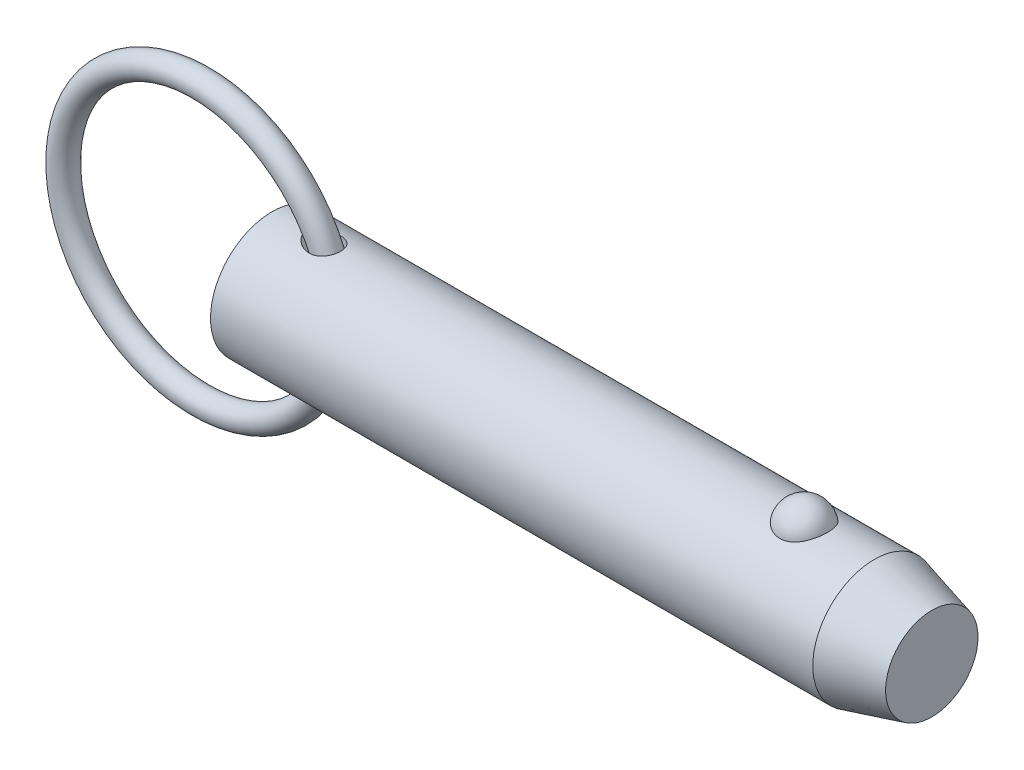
ISO-10303-21;
HEADER;
FILE_DESCRIPTION(('STEP AP214'),'2;1');
FILE_NAME('part.step','',(''),(''),'','','');
FILE_SCHEMA(('AUTOMOTIVE_DESIGN { 1 0 10303 214 1 1 1 1 }'));
ENDSEC;
DATA;
#1=APPLICATION_CONTEXT('core data for automotive mechanical design processes');
#2=APPLICATION_PROTOCOL_DEFINITION('international standard','automotive_design',2000,#1);
#3=PRODUCT_CONTEXT('',#1,'mechanical');
#4=PRODUCT('Part','Part','',(#3));
#5=PRODUCT_RELATED_PRODUCT_CATEGORY('part','',(#4));
#6=PRODUCT_DEFINITION_FORMATION('','',#4);
#7=PRODUCT_DEFINITION_CONTEXT('part definition',#1,'design');
#8=PRODUCT_DEFINITION('design','',#6,#7);
#9=PRODUCT_DEFINITION_SHAPE('','',#8);
#10=(LENGTH_UNIT() NAMED_UNIT(*) SI_UNIT(.MILLI.,.METRE.));
#11=(NAMED_UNIT(*) PLANE_ANGLE_UNIT() SI_UNIT($,.RADIAN.));
#12=(NAMED_UNIT(*) SI_UNIT($,.STERADIAN.) SOLID_ANGLE_UNIT());
#13=UNCERTAINTY_MEASURE_WITH_UNIT(LENGTH_MEASURE(1.E-05),#10,'distance_accuracy_value','');
#14=(GEOMETRIC_REPRESENTATION_CONTEXT(3) GLOBAL_UNCERTAINTY_ASSIGNED_CONTEXT((#13)) GLOBAL_UNIT_ASSIGNED_CONTEXT((#10,
#11,#12)) REPRESENTATION_CONTEXT('',''));
#15=CARTESIAN_POINT('',(0.,0.,0.));
#16=DIRECTION('',(0.,0.,1.));
#17=DIRECTION('',(1.,0.,0.));
#18=AXIS2_PLACEMENT_3D('',#15,#16,#17);
#19=CARTESIAN_POINT('',(-8.23730968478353,0.,0.));
#20=DIRECTION('',(0.,0.,1.));
#21=DIRECTION('',(1.,0.,0.));
#22=AXIS2_PLACEMENT_3D('',#19,#20,#21);
#23=TOROIDAL_SURFACE('',#22,15.875,1.422);
#24=CARTESIAN_POINT('',(9.05969031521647,0.,0.));
#25=VERTEX_POINT('',#24);
#26=VERTEX_LOOP('',#25);
#27=FACE_BOUND('',#26,.T.);
#28=ADVANCED_FACE('P0_F12',(#27),#23,.T.);
#29=CLOSED_SHELL('',(#28));
#30=MANIFOLD_SOLID_BREP('P0_B1',#29);
#31=CARTESIAN_POINT('',(0.,0.,0.));
#32=DIRECTION('',(1.,0.,0.));
#33=DIRECTION('',(0.,0.,-1.));
#34=AXIS2_PLACEMENT_3D('',#31,#32,#33);
#35=CYLINDRICAL_SURFACE('',#34,7.11);
#36=CARTESIAN_POINT('',(3.98467340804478,7.10072679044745,-0.363013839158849));
#37=CARTESIAN_POINT('',(4.00971652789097,7.09600153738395,-0.45539194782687));
#38=CARTESIAN_POINT('',(4.04401947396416,7.08958406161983,-0.545230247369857));
#39=CARTESIAN_POINT('',(4.12810160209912,7.07427055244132,-0.717157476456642));
#40=CARTESIAN_POINT('',(4.17791765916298,7.06536861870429,-0.799227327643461));
#41=CARTESIAN_POINT('',(4.28924471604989,7.04620300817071,-0.953469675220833));
#42=CARTESIAN_POINT('',(4.35063580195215,7.035953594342,-1.02573162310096));
#43=CARTESIAN_POINT('',(4.48282610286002,7.01493313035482,-1.16081412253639));
#44=CARTESIAN_POINT('',(4.55362244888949,7.00416223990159,-1.22363754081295));
#45=CARTESIAN_POINT('',(4.71659336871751,6.98090398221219,-1.35055080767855));
#46=CARTESIAN_POINT('',(4.81029272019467,6.96847103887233,-1.41269256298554));
#47=CARTESIAN_POINT('',(5.0057240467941,6.94515366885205,-1.52319699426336));
#48=CARTESIAN_POINT('',(5.10746392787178,6.93427079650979,-1.57154588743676));
#49=CARTESIAN_POINT('',(5.33503739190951,6.91346066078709,-1.66091325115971));
#50=CARTESIAN_POINT('',(5.46199550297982,6.90402388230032,-1.69921932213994));
#51=CARTESIAN_POINT('',(5.72084799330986,6.89024030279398,-1.75428261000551));
#52=CARTESIAN_POINT('',(5.85274301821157,6.88589416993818,-1.77103699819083));
#53=CARTESIAN_POINT('',(6.11557710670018,6.88337277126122,-1.78081990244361));
#54=CARTESIAN_POINT('',(6.24650031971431,6.88510489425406,-1.77420448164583));
#55=CARTESIAN_POINT('',(6.50446311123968,6.89478744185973,-1.73620392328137));
#56=CARTESIAN_POINT('',(6.6315075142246,6.90272978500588,-1.70485097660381));
#57=CARTESIAN_POINT('',(6.85933269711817,6.92243075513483,-1.62281888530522));
#58=CARTESIAN_POINT('',(6.96133251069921,6.93352131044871,-1.5753580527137));
#59=CARTESIAN_POINT('',(7.15436649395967,6.95824811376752,-1.46226310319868));
#60=CARTESIAN_POINT('',(7.24540699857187,6.97188287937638,-1.3966395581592));
#61=CARTESIAN_POINT('',(7.40446019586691,6.99838217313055,-1.25668991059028));
#62=CARTESIAN_POINT('',(7.473875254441,7.01118308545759,-1.18393777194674));
#63=CARTESIAN_POINT('',(7.59904891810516,7.03582803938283,-1.02736918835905));
#64=CARTESIAN_POINT('',(7.65481029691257,7.04767227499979,-0.943554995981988));
#65=CARTESIAN_POINT('',(7.74982438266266,7.06873077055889,-0.76979592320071));
#66=CARTESIAN_POINT('',(7.7894903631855,7.07800861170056,-0.680084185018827));
#67=CARTESIAN_POINT('',(7.85354088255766,7.09334756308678,-0.495102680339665));
#68=CARTESIAN_POINT('',(7.87792559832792,7.09940871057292,-0.399832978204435));
#69=CARTESIAN_POINT('',(7.9108898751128,7.10766731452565,-0.206294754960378));
#70=CARTESIAN_POINT('',(7.91944662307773,7.10985919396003,-0.108022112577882));
#71=CARTESIAN_POINT('',(7.920501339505,7.11012756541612,0.0886168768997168));
#72=CARTESIAN_POINT('',(7.91299895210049,7.10820396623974,0.186983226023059));
#73=CARTESIAN_POINT('',(7.88205794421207,7.10043733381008,0.381270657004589));
#74=CARTESIAN_POINT('',(7.85857985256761,7.09458459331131,0.477185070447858));
#75=CARTESIAN_POINT('',(7.79617406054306,7.07958431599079,0.663575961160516));
#76=CARTESIAN_POINT('',(7.75724672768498,7.07043685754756,0.754052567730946));
#77=CARTESIAN_POINT('',(7.66496731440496,7.04987259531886,0.926798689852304));
#78=CARTESIAN_POINT('',(7.61164530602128,7.0384605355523,1.00908483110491));
#79=CARTESIAN_POINT('',(7.49191707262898,7.01461776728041,1.16333092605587));
#80=CARTESIAN_POINT('',(7.42551210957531,7.00218715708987,1.235291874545));
#81=CARTESIAN_POINT('',(7.28164031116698,6.97770944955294,1.36680167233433));
#82=CARTESIAN_POINT('',(7.20420170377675,6.96566146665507,1.42638126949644));
#83=CARTESIAN_POINT('',(7.0403906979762,6.94319963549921,1.53199377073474));
#84=CARTESIAN_POINT('',(6.95401827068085,6.93278579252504,1.57802663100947));
#85=CARTESIAN_POINT('',(6.7731858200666,6.91444459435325,1.65656940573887));
#86=CARTESIAN_POINT('',(6.67860569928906,6.90656682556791,1.68881327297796));
#87=CARTESIAN_POINT('',(6.48544119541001,6.89422806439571,1.73849768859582));
#88=CARTESIAN_POINT('',(6.38685561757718,6.88976809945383,1.755933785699));
#89=CARTESIAN_POINT('',(6.18089829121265,6.88429907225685,1.77726234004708));
#90=CARTESIAN_POINT('',(6.07340937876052,6.88356485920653,1.78007646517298));
#91=CARTESIAN_POINT('',(5.85921220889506,6.886086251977,1.77029087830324));
#92=CARTESIAN_POINT('',(5.75250426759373,6.88934339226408,1.75768523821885));
#93=CARTESIAN_POINT('',(5.52848027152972,6.89994454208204,1.71563399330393));
#94=CARTESIAN_POINT('',(5.41155168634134,6.90775772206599,1.68424184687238));
#95=CARTESIAN_POINT('',(5.18376466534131,6.92670168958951,1.60454711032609));
#96=CARTESIAN_POINT('',(5.07291446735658,6.9378368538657,1.5562221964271));
#97=CARTESIAN_POINT('',(4.84835244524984,6.96347168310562,1.43744827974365));
#98=CARTESIAN_POINT('',(4.73562531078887,6.97820486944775,1.36517310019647));
#99=CARTESIAN_POINT('',(4.52504912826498,7.00822340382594,1.20158053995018));
#100=CARTESIAN_POINT('',(4.42717478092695,7.02350775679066,1.11029618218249));
#101=CARTESIAN_POINT('',(4.27935716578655,7.04784659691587,0.940654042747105));
#102=CARTESIAN_POINT('',(4.2239722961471,7.05736064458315,0.867099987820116));
#103=CARTESIAN_POINT('',(4.12558347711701,7.07469854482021,0.711919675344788));
#104=CARTESIAN_POINT('',(4.08256922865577,7.0825238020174,0.630300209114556));
#105=CARTESIAN_POINT('',(4.01142860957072,7.09565978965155,0.459428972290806));
#106=CARTESIAN_POINT('',(3.98346043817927,7.10094374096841,0.370107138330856));
#107=CARTESIAN_POINT('',(3.95517285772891,7.1063173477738,0.233358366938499));
#108=CARTESIAN_POINT('',(3.94802115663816,7.1076831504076,0.187321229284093));
#109=CARTESIAN_POINT('',(3.93842121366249,7.10951900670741,0.0947476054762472));
#110=CARTESIAN_POINT('',(3.93597129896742,7.10998937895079,0.0482113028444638));
#111=CARTESIAN_POINT('',(3.93584361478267,7.11001358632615,-0.0598597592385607));
#112=CARTESIAN_POINT('',(3.9399538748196,7.10922402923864,-0.121405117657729));
#113=CARTESIAN_POINT('',(3.95632793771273,7.10609781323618,-0.243320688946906));
#114=CARTESIAN_POINT('',(3.96859135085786,7.10376122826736,-0.303690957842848));
#115=CARTESIAN_POINT('',(3.98467340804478,7.10072679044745,-0.363013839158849));
#116=B_SPLINE_CURVE_WITH_KNOTS('',3,(#36,#37,#38,#39,#40,#41,#42,#43,#44,#45,#46,#47,#48,#49,
#50,#51,#52,#53,#54,#55,#56,#57,#58,#59,#60,#61,#62,#63,#64,#65,#66,#67,#68,#69,#70,#71,#72,#73,
#74,#75,#76,#77,#78,#79,#80,#81,#82,#83,#84,#85,#86,#87,#88,#89,#90,#91,#92,#93,#94,#95,#96,#97,
#98,#99,#100,#101,#102,#103,#104,#105,#106,#107,#108,#109,#110,#111,#112,#113,#114,#115),
.UNSPECIFIED.,.T.,.F.,(4,2,2,2,2,2,2,2,2,2,2,2,2,2,2,2,2,2,2,2,2,2,2,2,2,2,2,2,2,2,2,2,2,2,2,2,
2,2,2,4),(0.,0.287206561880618,0.575101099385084,0.860162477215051,1.14513709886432,
1.48324846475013,1.82169652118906,2.21865672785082,2.6156690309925,3.00665870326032,
3.39714041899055,3.73437585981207,4.07141541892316,4.37402271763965,4.67656849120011,
4.97076150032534,5.26495110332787,5.55956439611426,5.85418421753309,6.14953461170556,
6.44487798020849,6.73960905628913,7.03431171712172,7.32827352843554,7.6222362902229,
7.9216396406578,8.22113296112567,8.54242840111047,8.86384740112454,9.22635035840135,
9.58933304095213,9.99153142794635,10.3930368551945,10.6697219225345,10.9461759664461,
11.2254825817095,11.3650959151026,11.5046595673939,11.6891051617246,11.8735419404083),.UNSPECIFIED.);
#117=CARTESIAN_POINT('',(3.98467340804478,7.10072679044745,-0.363013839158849));
#118=VERTEX_POINT('',#117);
#119=EDGE_CURVE('P1_E40',#118,#118,#116,.T.);
#120=ORIENTED_EDGE('',*,*,#119,.T.);
#121=EDGE_LOOP('',(#120));
#122=FACE_BOUND('',#121,.T.);
#123=CARTESIAN_POINT('',(69.5362796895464,0.,0.));
#124=DIRECTION('',(1.,0.,0.));
#125=DIRECTION('',(0.,0.,-1.));
#126=AXIS2_PLACEMENT_3D('',#123,#124,#125);
#127=CIRCLE('',#126,7.11);
#128=CARTESIAN_POINT('',(69.5362796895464,0.,-7.11));
#129=VERTEX_POINT('',#128);
#130=EDGE_CURVE('P1_E25',#129,#129,#127,.T.);
#131=ORIENTED_EDGE('',*,*,#130,.F.);
#132=EDGE_LOOP('',(#131));
#133=FACE_BOUND('',#132,.T.);
#134=CARTESIAN_POINT('',(0.,0.,0.));
#135=DIRECTION('',(1.,0.,0.));
#136=DIRECTION('',(0.,0.,-1.));
#137=AXIS2_PLACEMENT_3D('',#134,#135,#136);
#138=CIRCLE('',#137,7.11);
#139=CARTESIAN_POINT('',(0.,0.,-7.11));
#140=VERTEX_POINT('',#139);
#141=EDGE_CURVE('P1_E9',#140,#140,#138,.T.);
#142=ORIENTED_EDGE('',*,*,#141,.T.);
#143=EDGE_LOOP('',(#142));
#144=FACE_BOUND('',#143,.T.);
#145=CARTESIAN_POINT('',(61.429258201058,6.53646663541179,2.79762469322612));
#146=CARTESIAN_POINT('',(61.2844296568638,6.53647876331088,2.79761243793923));
#147=CARTESIAN_POINT('',(61.139368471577,6.54144531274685,2.78608115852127));
#148=CARTESIAN_POINT('',(60.8532920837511,6.56077791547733,2.74023282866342));
#149=CARTESIAN_POINT('',(60.7122884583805,6.57516852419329,2.70585624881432));
#150=CARTESIAN_POINT('',(60.4388833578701,6.61165072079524,2.61544042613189));
#151=CARTESIAN_POINT('',(60.3064602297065,6.63372195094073,2.55945840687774));
#152=CARTESIAN_POINT('',(60.0532337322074,6.68316012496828,2.42742958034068));
#153=CARTESIAN_POINT('',(59.9324254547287,6.71052481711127,2.35139129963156));
#154=CARTESIAN_POINT('',(59.7016372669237,6.76860821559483,2.17866150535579));
#155=CARTESIAN_POINT('',(59.5920857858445,6.79940242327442,2.08142342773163));
#156=CARTESIAN_POINT('',(59.3903340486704,6.86050242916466,1.87020907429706));
#157=CARTESIAN_POINT('',(59.2981390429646,6.89080807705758,1.75622775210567));
#158=CARTESIAN_POINT('',(59.1292547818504,6.94923069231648,1.50900646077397));
#159=CARTESIAN_POINT('',(59.0534289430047,6.97719213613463,1.37513873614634));
#160=CARTESIAN_POINT('',(58.9242063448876,7.02647251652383,1.09584817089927));
#161=CARTESIAN_POINT('',(58.8708109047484,7.04779106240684,0.950424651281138));
#162=CARTESIAN_POINT('',(58.7871019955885,7.08180248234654,0.650508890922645));
#163=CARTESIAN_POINT('',(58.7570253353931,7.09440672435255,0.495940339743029));
#164=CARTESIAN_POINT('',(58.721473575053,7.10935121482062,0.183515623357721));
#165=CARTESIAN_POINT('',(58.7159974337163,7.11169189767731,0.0256595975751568));
#166=CARTESIAN_POINT('',(58.729700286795,7.10589702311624,-0.287512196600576));
#167=CARTESIAN_POINT('',(58.7486823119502,7.0978451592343,-0.442838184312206));
#168=CARTESIAN_POINT('',(58.8105745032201,7.07221860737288,-0.747830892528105));
#169=CARTESIAN_POINT('',(58.8534850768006,7.05464375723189,-0.897497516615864));
#170=CARTESIAN_POINT('',(58.9624527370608,7.01171031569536,-1.1872286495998));
#171=CARTESIAN_POINT('',(59.0285458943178,6.98633960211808,-1.32727778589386));
#172=CARTESIAN_POINT('',(59.1825362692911,6.93042258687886,-1.59370324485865));
#173=CARTESIAN_POINT('',(59.2704355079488,6.89987580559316,-1.72007829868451));
#174=CARTESIAN_POINT('',(59.4669269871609,6.83659510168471,-1.95657345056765));
#175=CARTESIAN_POINT('',(59.5756640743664,6.80384697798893,-2.0665695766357));
#176=CARTESIAN_POINT('',(59.8109686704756,6.7400183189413,-2.26611005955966));
#177=CARTESIAN_POINT('',(59.9375350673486,6.70893767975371,-2.35565569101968));
#178=CARTESIAN_POINT('',(60.2028454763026,6.65264442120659,-2.51019726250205));
#179=CARTESIAN_POINT('',(60.3413230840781,6.62733449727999,-2.57561395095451));
#180=CARTESIAN_POINT('',(60.6285194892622,6.58495995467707,-2.68211134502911));
#181=CARTESIAN_POINT('',(60.7772343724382,6.56789220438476,-2.72320129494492));
#182=CARTESIAN_POINT('',(61.0726268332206,6.54478663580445,-2.77825810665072));
#183=CARTESIAN_POINT('',(61.2190295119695,6.53823639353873,-2.7934872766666));
#184=CARTESIAN_POINT('',(61.5124700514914,6.53532718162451,-2.80028921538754));
#185=CARTESIAN_POINT('',(61.6595077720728,6.53896606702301,-2.79186696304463));
#186=CARTESIAN_POINT('',(61.9449210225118,6.55570357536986,-2.75232178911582));
#187=CARTESIAN_POINT('',(62.0834221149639,6.56848455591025,-2.72196077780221));
#188=CARTESIAN_POINT('',(62.3531142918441,6.60173528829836,-2.64028774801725));
#189=CARTESIAN_POINT('',(62.484304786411,6.62220565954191,-2.5889740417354));
#190=CARTESIAN_POINT('',(62.7388462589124,6.6691792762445,-2.46547820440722));
#191=CARTESIAN_POINT('',(62.8619691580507,6.69580233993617,-2.392872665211));
#192=CARTESIAN_POINT('',(63.0944418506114,6.75207041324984,-2.22915269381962));
#193=CARTESIAN_POINT('',(63.2037884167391,6.78171612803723,-2.1380339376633));
#194=CARTESIAN_POINT('',(63.411642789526,6.84264629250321,-1.93445592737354));
#195=CARTESIAN_POINT('',(63.5093178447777,6.87393748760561,-1.82114774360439));
#196=CARTESIAN_POINT('',(63.6850112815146,6.93345710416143,-1.57947787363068));
#197=CARTESIAN_POINT('',(63.7630261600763,6.96168497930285,-1.45111351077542));
#198=CARTESIAN_POINT('',(63.8999857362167,7.01307558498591,-1.17842708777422));
#199=CARTESIAN_POINT('',(63.9582588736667,7.03605262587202,-1.03373189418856));
#200=CARTESIAN_POINT('',(64.0510815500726,7.07340932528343,-0.735867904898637));
#201=CARTESIAN_POINT('',(64.0856311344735,7.08778900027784,-0.582699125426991));
#202=CARTESIAN_POINT('',(64.130274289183,7.10647639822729,-0.272420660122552));
#203=CARTESIAN_POINT('',(64.14039710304,7.11079616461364,-0.115315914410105));
#204=CARTESIAN_POINT('',(64.136061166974,7.10896059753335,0.198488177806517));
#205=CARTESIAN_POINT('',(64.1216031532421,7.10280557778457,0.355187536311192));
#206=CARTESIAN_POINT('',(64.0685727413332,7.08071500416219,0.662724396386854));
#207=CARTESIAN_POINT('',(64.0301505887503,7.06484039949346,0.813592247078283));
#208=CARTESIAN_POINT('',(63.930101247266,7.0249589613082,1.10629159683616));
#209=CARTESIAN_POINT('',(63.8684724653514,7.00095156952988,1.24812247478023));
#210=CARTESIAN_POINT('',(63.7227668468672,6.94706632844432,1.51976439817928));
#211=CARTESIAN_POINT('',(63.6385448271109,6.91715085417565,1.6494901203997));
#212=CARTESIAN_POINT('',(63.4495861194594,6.85470565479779,1.89231285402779));
#213=CARTESIAN_POINT('',(63.3448501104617,6.82217601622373,2.0054104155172));
#214=CARTESIAN_POINT('',(63.1171030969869,6.75805358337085,2.21190674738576));
#215=CARTESIAN_POINT('',(62.994082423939,6.72646129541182,2.30529503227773));
#216=CARTESIAN_POINT('',(62.7327347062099,6.66789520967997,2.4695990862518));
#217=CARTESIAN_POINT('',(62.5944019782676,6.64092313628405,2.5405064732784));
#218=CARTESIAN_POINT('',(62.3111828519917,6.59572583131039,2.65560045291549));
#219=CARTESIAN_POINT('',(62.1666660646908,6.57724013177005,2.70059539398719));
#220=CARTESIAN_POINT('',(61.8715469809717,6.55006426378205,2.76587321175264));
#221=CARTESIAN_POINT('',(61.7209640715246,6.54134511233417,2.78622922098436));
#222=CARTESIAN_POINT('',(61.5230463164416,6.53697847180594,2.79642434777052));
#223=CARTESIAN_POINT('',(61.4761644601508,6.53646270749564,2.79762866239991));
#224=CARTESIAN_POINT('',(61.429258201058,6.53646663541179,2.79762469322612));
#225=B_SPLINE_CURVE_WITH_KNOTS('',3,(#145,#146,#147,#148,#149,#150,#151,#152,#153,#154,#155,
#156,#157,#158,#159,#160,#161,#162,#163,#164,#165,#166,#167,#168,#169,#170,#171,#172,#173,#174,
#175,#176,#177,#178,#179,#180,#181,#182,#183,#184,#185,#186,#187,#188,#189,#190,#191,#192,#193,
#194,#195,#196,#197,#198,#199,#200,#201,#202,#203,#204,#205,#206,#207,#208,#209,#210,#211,#212,
#213,#214,#215,#216,#217,#218,#219,#220,#221,#222,#223,#224),.UNSPECIFIED.,.T.,.F.,(4,2,2,2,2,2,
2,2,2,2,2,2,2,2,2,2,2,2,2,2,2,2,2,2,2,2,2,2,2,2,2,2,2,2,2,2,2,2,2,4),(0.,0.434355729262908,
0.86984774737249,1.30419416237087,1.73835621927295,2.18541922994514,2.63261726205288,
3.09954261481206,3.56649542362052,4.03813031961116,4.50974525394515,4.97758575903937,
5.44543423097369,5.91401389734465,6.38263700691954,6.85464418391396,7.32662193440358,
7.78992971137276,8.25306131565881,8.69285754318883,9.13256119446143,9.55768625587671,
9.98284556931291,10.4171106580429,10.851477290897,11.3079089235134,11.7644218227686,
12.2351898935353,12.7059570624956,13.1761603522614,13.6463495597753,14.1136200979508,
14.5809227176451,15.0513032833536,15.5216682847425,15.9922828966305,16.4630727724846,
16.9182457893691,17.3720644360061,17.5127411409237),.UNSPECIFIED.);
#226=CARTESIAN_POINT('',(61.429258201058,6.53646663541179,2.79762469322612));
#227=VERTEX_POINT('',#226);
#228=EDGE_CURVE('P1_E34',#227,#227,#225,.T.);
#229=ORIENTED_EDGE('',*,*,#228,.T.);
#230=EDGE_LOOP('',(#229));
#231=FACE_BOUND('',#230,.T.);
#232=CARTESIAN_POINT('',(3.98467340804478,-7.10072679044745,-0.363013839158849));
#233=CARTESIAN_POINT('',(3.96426456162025,-7.10457733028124,-0.287714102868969));
#234=CARTESIAN_POINT('',(3.95000501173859,-7.10730349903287,-0.210695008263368));
#235=CARTESIAN_POINT('',(3.93481801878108,-7.11020840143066,-0.0553038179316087));
#236=CARTESIAN_POINT('',(3.93388435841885,-7.11038832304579,0.0230676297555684));
#237=CARTESIAN_POINT('',(3.94541910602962,-7.10817995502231,0.178714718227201));
#238=CARTESIAN_POINT('',(3.95787987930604,-7.10579312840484,0.25599095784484));
#239=CARTESIAN_POINT('',(3.99523775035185,-7.09872642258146,0.407352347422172));
#240=CARTESIAN_POINT('',(4.02014065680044,-7.09404547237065,0.481435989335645));
#241=CARTESIAN_POINT('',(4.08119600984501,-7.08278363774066,0.625775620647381));
#242=CARTESIAN_POINT('',(4.11749458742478,-7.07617815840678,0.695967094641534));
#243=CARTESIAN_POINT('',(4.19940836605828,-7.06165305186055,0.830508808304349));
#244=CARTESIAN_POINT('',(4.24502952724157,-7.0537325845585,0.894855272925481));
#245=CARTESIAN_POINT('',(4.36790232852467,-7.03310314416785,1.04688574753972));
#246=CARTESIAN_POINT('',(4.44977459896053,-7.01993229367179,1.13078695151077));
#247=CARTESIAN_POINT('',(4.62610796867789,-6.99351259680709,1.28411726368));
#248=CARTESIAN_POINT('',(4.7205898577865,-6.98026365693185,1.35352197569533));
#249=CARTESIAN_POINT('',(4.92036507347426,-6.9549104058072,1.47831921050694));
#250=CARTESIAN_POINT('',(5.02579054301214,-6.94282458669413,1.53350332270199));
#251=CARTESIAN_POINT('',(5.24378330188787,-6.92129098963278,1.62793610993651));
#252=CARTESIAN_POINT('',(5.35635066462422,-6.91184323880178,1.66718462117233));
#253=CARTESIAN_POINT('',(5.60134354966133,-6.89573491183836,1.73269893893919));
#254=CARTESIAN_POINT('',(5.73444697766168,-6.8895970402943,1.75661057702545));
#255=CARTESIAN_POINT('',(6.00300738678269,-6.88344616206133,1.78057487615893));
#256=CARTESIAN_POINT('',(6.13846360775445,-6.88343121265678,1.78063510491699));
#257=CARTESIAN_POINT('',(6.39660470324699,-6.88981379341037,1.75576480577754));
#258=CARTESIAN_POINT('',(6.51947843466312,-6.89572457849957,1.73273121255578));
#259=CARTESIAN_POINT('',(6.75813770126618,-6.91274434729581,1.66352936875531));
#260=CARTESIAN_POINT('',(6.87393155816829,-6.92384709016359,1.61738888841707));
#261=CARTESIAN_POINT('',(7.07801861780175,-6.94787316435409,1.51052664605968));
#262=CARTESIAN_POINT('',(7.16789841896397,-6.96033024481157,1.45271574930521));
#263=CARTESIAN_POINT('',(7.33546773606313,-6.98638661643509,1.32171912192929));
#264=CARTESIAN_POINT('',(7.41316182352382,-6.99998547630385,1.24853918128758));
#265=CARTESIAN_POINT('',(7.54861420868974,-7.02559503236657,1.09486170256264));
#266=CARTESIAN_POINT('',(7.60741145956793,-7.03764930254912,1.01528346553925));
#267=CARTESIAN_POINT('',(7.71070740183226,-7.0598657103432,0.847099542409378));
#268=CARTESIAN_POINT('',(7.75520788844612,-7.0700280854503,0.758494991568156));
#269=CARTESIAN_POINT('',(7.82836147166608,-7.08722075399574,0.575936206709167));
#270=CARTESIAN_POINT('',(7.85719783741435,-7.09428707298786,0.482058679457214));
#271=CARTESIAN_POINT('',(7.89918378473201,-7.10470260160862,0.29065874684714));
#272=CARTESIAN_POINT('',(7.91233308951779,-7.10805174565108,0.193136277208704));
#273=CARTESIAN_POINT('',(7.92267451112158,-7.11067890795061,-0.00313968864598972));
#274=CARTESIAN_POINT('',(7.91981203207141,-7.10994299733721,-0.10189624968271));
#275=CARTESIAN_POINT('',(7.89806489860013,-7.10444651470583,-0.297516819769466));
#276=CARTESIAN_POINT('',(7.87918005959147,-7.09968589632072,-0.394380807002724));
#277=CARTESIAN_POINT('',(7.82577988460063,-7.0866471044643,-0.58355375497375));
#278=CARTESIAN_POINT('',(7.79124976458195,-7.07836560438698,-0.675858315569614));
#279=CARTESIAN_POINT('',(7.70736343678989,-7.05919003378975,-0.853167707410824));
#280=CARTESIAN_POINT('',(7.65800801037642,-7.04829610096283,-0.938172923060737));
#281=CARTESIAN_POINT('',(7.54590141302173,-7.02513961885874,-1.09819812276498));
#282=CARTESIAN_POINT('',(7.48319521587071,-7.01288172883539,-1.17325029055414));
#283=CARTESIAN_POINT('',(7.34599775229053,-6.98832192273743,-1.31164333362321));
#284=CARTESIAN_POINT('',(7.27150757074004,-6.97602001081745,-1.37498528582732));
#285=CARTESIAN_POINT('',(7.11277776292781,-6.95268608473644,-1.48849974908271));
#286=CARTESIAN_POINT('',(7.02852525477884,-6.94165578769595,-1.53865456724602));
#287=CARTESIAN_POINT('',(6.85282430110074,-6.92200320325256,-1.62478650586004));
#288=CARTESIAN_POINT('',(6.76137511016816,-6.91338116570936,-1.66076215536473));
#289=CARTESIAN_POINT('',(6.57061179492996,-6.89906044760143,-1.71930563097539));
#290=CARTESIAN_POINT('',(6.47113516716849,-6.89347290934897,-1.74136795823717));
#291=CARTESIAN_POINT('',(6.26989833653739,-6.88605020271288,-1.7704895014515));
#292=CARTESIAN_POINT('',(6.16813737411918,-6.88421630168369,-1.77754365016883));
#293=CARTESIAN_POINT('',(5.95492537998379,-6.88424071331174,-1.77745174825));
#294=CARTESIAN_POINT('',(5.8434768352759,-6.88646827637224,-1.76888555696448));
#295=CARTESIAN_POINT('',(5.62307560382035,-6.89483827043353,-1.73596677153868));
#296=CARTESIAN_POINT('',(5.51412477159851,-6.90098351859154,-1.71160281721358));
#297=CARTESIAN_POINT('',(5.28644478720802,-6.91743803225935,-1.64393691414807));
#298=CARTESIAN_POINT('',(5.16837217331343,-6.92819628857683,-1.59852806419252));
#299=CARTESIAN_POINT('',(4.94091825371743,-6.95234836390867,-1.4899796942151));
#300=CARTESIAN_POINT('',(4.83153887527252,-6.96574276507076,-1.42683625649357));
#301=CARTESIAN_POINT('',(4.63576710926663,-6.99209234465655,-1.29112257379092));
#302=CARTESIAN_POINT('',(4.54816728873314,-7.00494184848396,-1.22027748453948));
#303=CARTESIAN_POINT('',(4.38554897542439,-7.03019055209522,-1.0652111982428));
#304=CARTESIAN_POINT('',(4.31052141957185,-7.04259007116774,-0.980999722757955));
#305=CARTESIAN_POINT('',(4.18551811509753,-7.0640229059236,-0.811206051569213));
#306=CARTESIAN_POINT('',(4.13358417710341,-7.07328321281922,-0.727107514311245));
#307=CARTESIAN_POINT('',(4.04607461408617,-7.0891994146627,-0.550580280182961));
#308=CARTESIAN_POINT('',(4.01046401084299,-7.09586087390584,-0.458169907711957));
#309=CARTESIAN_POINT('',(3.98467340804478,-7.10072679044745,-0.363013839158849));
#310=B_SPLINE_CURVE_WITH_KNOTS('',3,(#232,#233,#234,#235,#236,#237,#238,#239,#240,#241,#242,
#243,#244,#245,#246,#247,#248,#249,#250,#251,#252,#253,#254,#255,#256,#257,#258,#259,#260,#261,
#262,#263,#264,#265,#266,#267,#268,#269,#270,#271,#272,#273,#274,#275,#276,#277,#278,#279,#280,
#281,#282,#283,#284,#285,#286,#287,#288,#289,#290,#291,#292,#293,#294,#295,#296,#297,#298,#299,
#300,#301,#302,#303,#304,#305,#306,#307,#308,#309),.UNSPECIFIED.,.T.,.F.,(4,2,2,2,2,2,2,2,2,2,2,
2,2,2,2,2,2,2,2,2,2,2,2,2,2,2,2,2,2,2,2,2,2,2,2,2,2,2,4),(0.,0.23402065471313,0.467932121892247,
0.701710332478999,0.935597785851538,1.17261620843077,1.40978663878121,1.76177576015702,
2.11435255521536,2.47183528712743,2.8293216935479,3.23332937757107,3.63720887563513,
4.01042610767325,4.38319587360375,4.70425151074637,5.02518641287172,5.32277979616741,
5.62033579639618,5.91433101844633,6.2083314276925,6.50333490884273,6.79834178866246,
7.09362801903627,7.38889868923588,7.6831900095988,7.9774542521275,8.27211131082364,
8.56679892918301,8.8716552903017,9.17661456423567,9.51069129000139,9.84500851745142,
10.2243046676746,10.6036846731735,10.9425776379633,11.2812252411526,11.5775945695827,
11.8733258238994),.UNSPECIFIED.);
#311=CARTESIAN_POINT('',(3.98467340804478,-7.10072679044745,-0.363013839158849));
#312=VERTEX_POINT('',#311);
#313=EDGE_CURVE('P1_E17',#312,#312,#310,.T.);
#314=ORIENTED_EDGE('',*,*,#313,.T.);
#315=EDGE_LOOP('',(#314));
#316=FACE_BOUND('',#315,.T.);
#317=ADVANCED_FACE('P1_F13',(#122,#133,#144,#231,#316),#35,.T.);
#318=CARTESIAN_POINT('',(0.,0.,0.));
#319=DIRECTION('',(-1.,0.,0.));
#320=DIRECTION('',(0.,0.,1.));
#321=AXIS2_PLACEMENT_3D('',#318,#319,#320);
#322=PLANE('',#321);
#323=ORIENTED_EDGE('',*,*,#141,.F.);
#324=EDGE_LOOP('',(#323));
#325=FACE_BOUND('',#324,.T.);
#326=ADVANCED_FACE('P1_F15',(#325),#322,.T.);
#327=CARTESIAN_POINT('',(76.17,0.,0.));
#328=DIRECTION('',(-1.,0.,0.));
#329=DIRECTION('',(0.,0.,1.));
#330=AXIS2_PLACEMENT_3D('',#327,#328,#329);
#331=CONICAL_SURFACE('',#330,5.33250000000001,0.26179938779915);
#332=ORIENTED_EDGE('',*,*,#130,.T.);
#333=EDGE_LOOP('',(#332));
#334=FACE_BOUND('',#333,.T.);
#335=CARTESIAN_POINT('',(76.17,0.,0.));
#336=DIRECTION('',(1.,0.,0.));
#337=DIRECTION('',(0.,0.,-1.));
#338=AXIS2_PLACEMENT_3D('',#335,#336,#337);
#339=CIRCLE('',#338,5.33250000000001);
#340=CARTESIAN_POINT('',(76.17,0.,-5.33250000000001));
#341=VERTEX_POINT('',#340);
#342=EDGE_CURVE('P1_E30',#341,#341,#339,.T.);
#343=ORIENTED_EDGE('',*,*,#342,.F.);
#344=EDGE_LOOP('',(#343));
#345=FACE_BOUND('',#344,.T.);
#346=ADVANCED_FACE('P1_F55',(#334,#345),#331,.T.);
#347=CARTESIAN_POINT('',(76.17,5.33250000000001,0.));
#348=DIRECTION('',(1.,0.,0.));
#349=DIRECTION('',(0.,0.,-1.));
#350=AXIS2_PLACEMENT_3D('',#347,#348,#349);
#351=PLANE('',#350);
#352=ORIENTED_EDGE('',*,*,#342,.T.);
#353=EDGE_LOOP('',(#352));
#354=FACE_BOUND('',#353,.T.);
#355=ADVANCED_FACE('P1_F51',(#354),#351,.T.);
#356=CARTESIAN_POINT('',(61.429258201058,6.399,0.));
#357=DIRECTION('',(-1.,0.,0.));
#358=DIRECTION('',(0.,-1.,0.));
#359=AXIS2_PLACEMENT_3D('',#356,#357,#358);
#360=SPHERICAL_SURFACE('',#359,2.80099999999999);
#361=ORIENTED_EDGE('',*,*,#228,.F.);
#362=EDGE_LOOP('',(#361));
#363=FACE_BOUND('',#362,.T.);
#364=ADVANCED_FACE('P1_F46',(#363),#360,.T.);
#365=CARTESIAN_POINT('',(-8.23730968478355,0.,0.));
#366=DIRECTION('',(0.,0.,1.));
#367=DIRECTION('',(1.,0.,0.));
#368=AXIS2_PLACEMENT_3D('',#365,#366,#367);
#369=TOROIDAL_SURFACE('',#368,15.875,1.7775);
#370=ORIENTED_EDGE('',*,*,#313,.F.);
#371=EDGE_LOOP('',(#370));
#372=FACE_BOUND('',#371,.T.);
#373=ORIENTED_EDGE('',*,*,#119,.F.);
#374=EDGE_LOOP('',(#373));
#375=FACE_BOUND('',#374,.T.);
#376=ADVANCED_FACE('P1_F50',(#372,#375),#369,.F.);
#377=CLOSED_SHELL('',(#317,#326,#346,#355,#364,#376));
#378=MANIFOLD_SOLID_BREP('P1_B1',#377);
#379=ADVANCED_BREP_SHAPE_REPRESENTATION('',(#18,#30,#378),#14);
#380=SHAPE_DEFINITION_REPRESENTATION(#9,#379);
ENDSEC;
END-ISO-10303-21;
